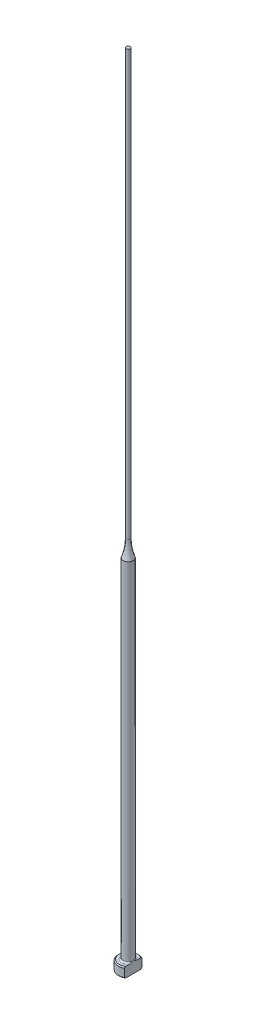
from build123d import *
from build123d.topology import SkipClean

# Parameters (mm, degrees)
CHAMFER1_SIZE = 0.2
FILLET1_R     = 0.3
KEY_DEPTH     = 161.024998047


with BuildPart() as part:
    # Sketch1 → Revolve1 (revolve)
    with BuildSketch(Plane.XY, mode=Mode.PRIVATE) as revolve1_sk:
        with BuildLine():
            Line((0, 0), (-2, 0))
            Line((-2, 0), (-2, 2))
            Line((-2, 2), (-1, 2))
            Line((-1, 2), (-1, 71.588255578))
            ThreePointArc((-1, 71.588255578), (-0.551142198, 73.267949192), (-0.4, 75))
            Line((-0.4, 75), (-0.4, 160))
            Line((-0.4, 160), (0, 160))
            Line((0, 160), (0, 0))
        make_face()
    revolve(revolve1_sk.sketch.rotate(Axis((0, 259.958771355, 0), (0, -1, 0)), 270), axis=Axis((0, 259.958771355, 0), (0, -1, 0)))

    # Chamfer1
    chamfer1_edges = [part.edges().sort_by_distance(p)[0] for p in [
        (0, 0, -2),
        (0, 2, -2),
    ]]
    chamfer(chamfer1_edges, length=CHAMFER1_SIZE)

    # Fillet1
    fillet1_edges = [part.edges().sort_by_distance(p)[0] for p in [
        (0, 2, -1),
    ]]
    fillet(fillet1_edges, radius=FILLET1_R)

    # Sketch2 → KEY (cut, through all)
    with SkipClean():  # the faces are left unmerged after this step: merging them gives an invalid solid
        with BuildSketch(Plane(origin=(0, 0, 0), x_dir=(1, 0, 0), z_dir=(0, 1, 0))):
            with BuildLine():
                Line((1, 1.732050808), (1, -1.732050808))
                ThreePointArc((1, -1.732050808), (2, 0), (1, 1.732050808))
            make_face()
        extrude(amount=KEY_DEPTH, mode=Mode.SUBTRACT)


solid = part.part
